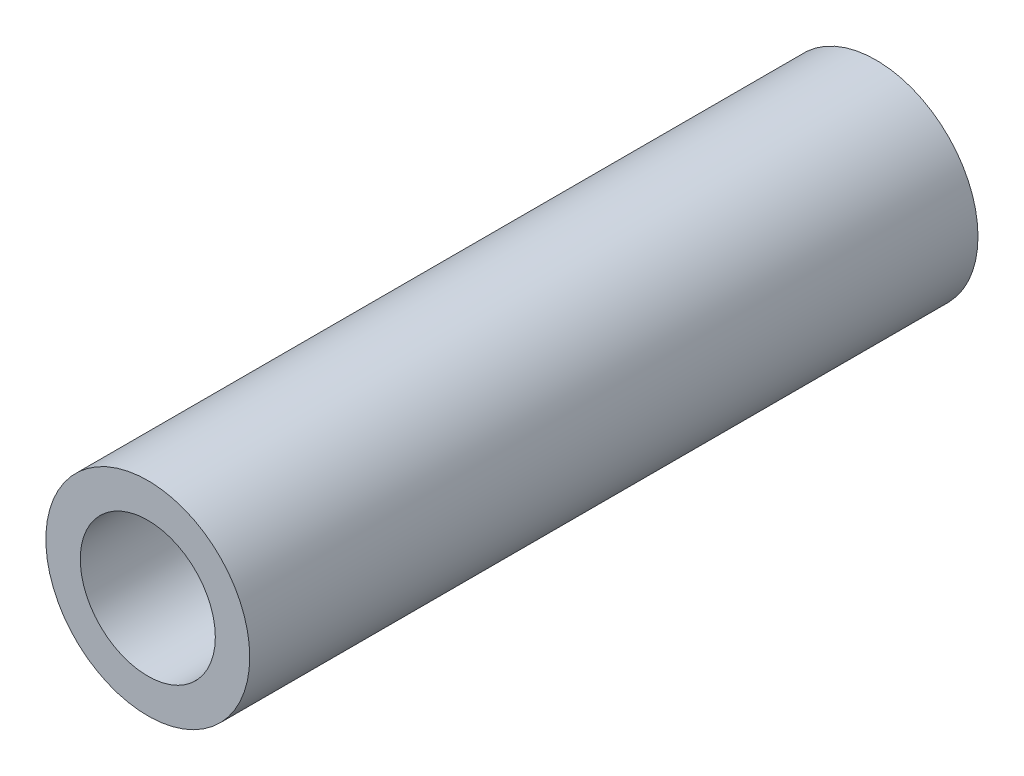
ISO-10303-21;
HEADER;
FILE_DESCRIPTION(('STEP AP214'),'2;1');
FILE_NAME('part.step','',(''),(''),'','','');
FILE_SCHEMA(('AUTOMOTIVE_DESIGN { 1 0 10303 214 1 1 1 1 }'));
ENDSEC;
DATA;
#1=APPLICATION_CONTEXT('core data for automotive mechanical design processes');
#2=APPLICATION_PROTOCOL_DEFINITION('international standard','automotive_design',2000,#1);
#3=PRODUCT_CONTEXT('',#1,'mechanical');
#4=PRODUCT('Part','Part','',(#3));
#5=PRODUCT_RELATED_PRODUCT_CATEGORY('part','',(#4));
#6=PRODUCT_DEFINITION_FORMATION('','',#4);
#7=PRODUCT_DEFINITION_CONTEXT('part definition',#1,'design');
#8=PRODUCT_DEFINITION('design','',#6,#7);
#9=PRODUCT_DEFINITION_SHAPE('','',#8);
#10=(LENGTH_UNIT() NAMED_UNIT(*) SI_UNIT(.MILLI.,.METRE.));
#11=(NAMED_UNIT(*) PLANE_ANGLE_UNIT() SI_UNIT($,.RADIAN.));
#12=(NAMED_UNIT(*) SI_UNIT($,.STERADIAN.) SOLID_ANGLE_UNIT());
#13=UNCERTAINTY_MEASURE_WITH_UNIT(LENGTH_MEASURE(1.E-05),#10,'distance_accuracy_value','');
#14=(GEOMETRIC_REPRESENTATION_CONTEXT(3) GLOBAL_UNCERTAINTY_ASSIGNED_CONTEXT((#13)) GLOBAL_UNIT_ASSIGNED_CONTEXT((#10,
#11,#12)) REPRESENTATION_CONTEXT('',''));
#15=CARTESIAN_POINT('',(0.,0.,0.));
#16=DIRECTION('',(0.,0.,1.));
#17=DIRECTION('',(1.,0.,0.));
#18=AXIS2_PLACEMENT_3D('',#15,#16,#17);
#19=CARTESIAN_POINT('',(0.,0.,28.575));
#20=DIRECTION('',(0.,0.,-1.));
#21=DIRECTION('',(-1.,0.,0.));
#22=AXIS2_PLACEMENT_3D('',#19,#20,#21);
#23=CYLINDRICAL_SURFACE('',#22,2.65);
#24=CARTESIAN_POINT('',(0.,0.,28.575));
#25=DIRECTION('',(0.,0.,1.));
#26=DIRECTION('',(1.,0.,0.));
#27=AXIS2_PLACEMENT_3D('',#24,#25,#26);
#28=CIRCLE('',#27,2.65);
#29=CARTESIAN_POINT('',(2.65,0.,28.575));
#30=VERTEX_POINT('',#29);
#31=EDGE_CURVE('E37',#30,#30,#28,.T.);
#32=ORIENTED_EDGE('',*,*,#31,.T.);
#33=EDGE_LOOP('',(#32));
#34=FACE_BOUND('',#33,.T.);
#35=CARTESIAN_POINT('',(0.,0.,0.));
#36=DIRECTION('',(0.,0.,1.));
#37=DIRECTION('',(1.,0.,0.));
#38=AXIS2_PLACEMENT_3D('',#35,#36,#37);
#39=CIRCLE('',#38,2.65);
#40=CARTESIAN_POINT('',(2.65,0.,0.));
#41=VERTEX_POINT('',#40);
#42=EDGE_CURVE('E43',#41,#41,#39,.T.);
#43=ORIENTED_EDGE('',*,*,#42,.F.);
#44=EDGE_LOOP('',(#43));
#45=FACE_BOUND('',#44,.T.);
#46=ADVANCED_FACE('F30',(#34,#45),#23,.F.);
#47=CARTESIAN_POINT('',(0.,0.,28.575));
#48=DIRECTION('',(0.,0.,-1.));
#49=DIRECTION('',(-1.,0.,0.));
#50=AXIS2_PLACEMENT_3D('',#47,#48,#49);
#51=CYLINDRICAL_SURFACE('',#50,4.);
#52=CARTESIAN_POINT('',(0.,0.,28.575));
#53=DIRECTION('',(0.,0.,1.));
#54=DIRECTION('',(1.,0.,0.));
#55=AXIS2_PLACEMENT_3D('',#52,#53,#54);
#56=CIRCLE('',#55,4.);
#57=CARTESIAN_POINT('',(4.,0.,28.575));
#58=VERTEX_POINT('',#57);
#59=EDGE_CURVE('E10',#58,#58,#56,.T.);
#60=ORIENTED_EDGE('',*,*,#59,.F.);
#61=EDGE_LOOP('',(#60));
#62=FACE_BOUND('',#61,.T.);
#63=CARTESIAN_POINT('',(0.,0.,0.));
#64=DIRECTION('',(0.,0.,1.));
#65=DIRECTION('',(1.,0.,0.));
#66=AXIS2_PLACEMENT_3D('',#63,#64,#65);
#67=CIRCLE('',#66,4.);
#68=CARTESIAN_POINT('',(4.,0.,0.));
#69=VERTEX_POINT('',#68);
#70=EDGE_CURVE('E33',#69,#69,#67,.T.);
#71=ORIENTED_EDGE('',*,*,#70,.T.);
#72=EDGE_LOOP('',(#71));
#73=FACE_BOUND('',#72,.T.);
#74=ADVANCED_FACE('F50',(#62,#73),#51,.T.);
#75=CARTESIAN_POINT('',(0.,-8.94142135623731,28.575));
#76=DIRECTION('',(0.,0.,1.));
#77=DIRECTION('',(1.,0.,0.));
#78=AXIS2_PLACEMENT_3D('',#75,#76,#77);
#79=PLANE('',#78);
#80=ORIENTED_EDGE('',*,*,#31,.F.);
#81=EDGE_LOOP('',(#80));
#82=FACE_BOUND('',#81,.T.);
#83=ORIENTED_EDGE('',*,*,#59,.T.);
#84=EDGE_LOOP('',(#83));
#85=FACE_BOUND('',#84,.T.);
#86=ADVANCED_FACE('F54',(#82,#85),#79,.T.);
#87=CARTESIAN_POINT('',(0.,-8.94142135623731,0.));
#88=DIRECTION('',(0.,0.,1.));
#89=DIRECTION('',(1.,0.,0.));
#90=AXIS2_PLACEMENT_3D('',#87,#88,#89);
#91=PLANE('',#90);
#92=ORIENTED_EDGE('',*,*,#42,.T.);
#93=EDGE_LOOP('',(#92));
#94=FACE_BOUND('',#93,.T.);
#95=ORIENTED_EDGE('',*,*,#70,.F.);
#96=EDGE_LOOP('',(#95));
#97=FACE_BOUND('',#96,.T.);
#98=ADVANCED_FACE('F52',(#94,#97),#91,.F.);
#99=CLOSED_SHELL('',(#46,#74,#86,#98));
#100=MANIFOLD_SOLID_BREP('B2',#99);
#101=ADVANCED_BREP_SHAPE_REPRESENTATION('',(#18,#100),#14);
#102=SHAPE_DEFINITION_REPRESENTATION(#9,#101);
ENDSEC;
END-ISO-10303-21;
